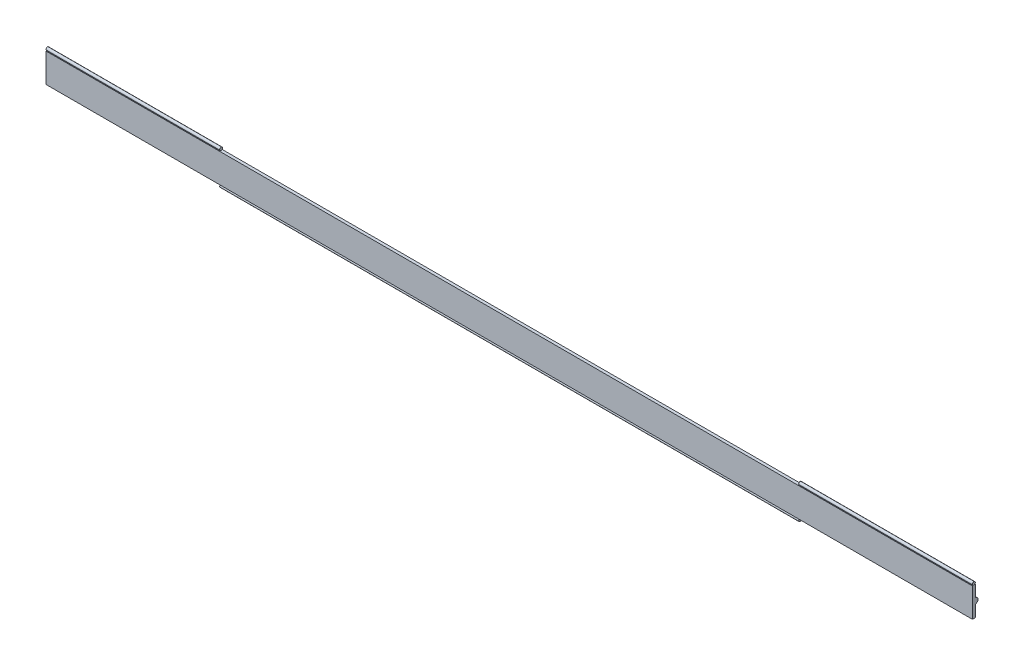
ISO-10303-21;
HEADER;
FILE_DESCRIPTION(('STEP AP214'),'2;1');
FILE_NAME('part.step','',(''),(''),'','','');
FILE_SCHEMA(('AUTOMOTIVE_DESIGN { 1 0 10303 214 1 1 1 1 }'));
ENDSEC;
DATA;
#1=APPLICATION_CONTEXT('core data for automotive mechanical design processes');
#2=APPLICATION_PROTOCOL_DEFINITION('international standard','automotive_design',2000,#1);
#3=PRODUCT_CONTEXT('',#1,'mechanical');
#4=PRODUCT('Part','Part','',(#3));
#5=PRODUCT_RELATED_PRODUCT_CATEGORY('part','',(#4));
#6=PRODUCT_DEFINITION_FORMATION('','',#4);
#7=PRODUCT_DEFINITION_CONTEXT('part definition',#1,'design');
#8=PRODUCT_DEFINITION('design','',#6,#7);
#9=PRODUCT_DEFINITION_SHAPE('','',#8);
#10=(LENGTH_UNIT() NAMED_UNIT(*) SI_UNIT(.MILLI.,.METRE.));
#11=(NAMED_UNIT(*) PLANE_ANGLE_UNIT() SI_UNIT($,.RADIAN.));
#12=(NAMED_UNIT(*) SI_UNIT($,.STERADIAN.) SOLID_ANGLE_UNIT());
#13=UNCERTAINTY_MEASURE_WITH_UNIT(LENGTH_MEASURE(1.E-05),#10,'distance_accuracy_value','');
#14=(GEOMETRIC_REPRESENTATION_CONTEXT(3) GLOBAL_UNCERTAINTY_ASSIGNED_CONTEXT((#13)) GLOBAL_UNIT_ASSIGNED_CONTEXT((#10,
#11,#12)) REPRESENTATION_CONTEXT('',''));
#15=CARTESIAN_POINT('',(0.,0.,0.));
#16=DIRECTION('',(0.,0.,1.));
#17=DIRECTION('',(1.,0.,0.));
#18=AXIS2_PLACEMENT_3D('',#15,#16,#17);
#19=CARTESIAN_POINT('',(0.,26.67,1.27));
#20=DIRECTION('',(1.,0.,0.));
#21=DIRECTION('',(0.,0.,-1.));
#22=AXIS2_PLACEMENT_3D('',#19,#20,#21);
#23=CYLINDRICAL_SURFACE('',#22,1.27);
#24=CARTESIAN_POINT('',(660.4,26.67,1.27));
#25=DIRECTION('',(1.,0.,0.));
#26=DIRECTION('',(0.,0.,-1.));
#27=AXIS2_PLACEMENT_3D('',#24,#25,#26);
#28=CIRCLE('',#27,1.27);
#29=CARTESIAN_POINT('',(660.4,26.67,0.));
#30=VERTEX_POINT('',#29);
#31=EDGE_CURVE('E11',#30,#30,#28,.F.);
#32=ORIENTED_EDGE('',*,*,#31,.F.);
#33=EDGE_LOOP('',(#32));
#34=FACE_BOUND('',#33,.T.);
#35=CARTESIAN_POINT('',(812.8,26.67,1.27));
#36=DIRECTION('',(1.,0.,0.));
#37=DIRECTION('',(0.,0.,-1.));
#38=AXIS2_PLACEMENT_3D('',#35,#36,#37);
#39=CIRCLE('',#38,1.27);
#40=CARTESIAN_POINT('',(812.8,26.67,0.));
#41=VERTEX_POINT('',#40);
#42=EDGE_CURVE('E42',#41,#41,#39,.T.);
#43=ORIENTED_EDGE('',*,*,#42,.F.);
#44=EDGE_LOOP('',(#43));
#45=FACE_BOUND('',#44,.T.);
#46=ADVANCED_FACE('F39',(#34,#45),#23,.T.);
#47=CARTESIAN_POINT('',(812.8,26.67,1.27));
#48=DIRECTION('',(1.,0.,0.));
#49=DIRECTION('',(0.,0.,-1.));
#50=AXIS2_PLACEMENT_3D('',#47,#48,#49);
#51=PLANE('',#50);
#52=ORIENTED_EDGE('',*,*,#42,.T.);
#53=EDGE_LOOP('',(#52));
#54=FACE_BOUND('',#53,.T.);
#55=ADVANCED_FACE('F51',(#54),#51,.T.);
#56=CARTESIAN_POINT('',(660.4,44.4709717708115,2.54));
#57=DIRECTION('',(1.,0.,0.));
#58=DIRECTION('',(0.,0.,-1.));
#59=AXIS2_PLACEMENT_3D('',#56,#57,#58);
#60=PLANE('',#59);
#61=ORIENTED_EDGE('',*,*,#31,.T.);
#62=EDGE_LOOP('',(#61));
#63=FACE_BOUND('',#62,.T.);
#64=ADVANCED_FACE('F58',(#63),#60,.F.);
#65=CLOSED_SHELL('',(#46,#55,#64));
#66=MANIFOLD_SOLID_BREP('B2',#65);
#67=CARTESIAN_POINT('',(0.,26.67,1.27));
#68=DIRECTION('',(1.,0.,0.));
#69=DIRECTION('',(0.,0.,-1.));
#70=AXIS2_PLACEMENT_3D('',#67,#68,#69);
#71=PLANE('',#70);
#72=CARTESIAN_POINT('',(0.,26.67,1.27));
#73=DIRECTION('',(1.,0.,0.));
#74=DIRECTION('',(0.,0.,-1.));
#75=AXIS2_PLACEMENT_3D('',#72,#73,#74);
#76=CIRCLE('',#75,1.27);
#77=CARTESIAN_POINT('',(0.,26.67,0.));
#78=VERTEX_POINT('',#77);
#79=EDGE_CURVE('E94',#78,#78,#76,.T.);
#80=ORIENTED_EDGE('',*,*,#79,.F.);
#81=EDGE_LOOP('',(#80));
#82=FACE_BOUND('',#81,.T.);
#83=ADVANCED_FACE('F87',(#82),#71,.F.);
#84=CARTESIAN_POINT('',(0.,26.67,1.27));
#85=DIRECTION('',(1.,0.,0.));
#86=DIRECTION('',(0.,0.,-1.));
#87=AXIS2_PLACEMENT_3D('',#84,#85,#86);
#88=CYLINDRICAL_SURFACE('',#87,1.27);
#89=CARTESIAN_POINT('',(152.4,26.67,1.27));
#90=DIRECTION('',(-1.,0.,0.));
#91=DIRECTION('',(0.,0.,1.));
#92=AXIS2_PLACEMENT_3D('',#89,#90,#91);
#93=CIRCLE('',#92,1.27);
#94=CARTESIAN_POINT('',(152.4,26.67,2.54));
#95=VERTEX_POINT('',#94);
#96=EDGE_CURVE('E38',#95,#95,#93,.F.);
#97=ORIENTED_EDGE('',*,*,#96,.F.);
#98=EDGE_LOOP('',(#97));
#99=FACE_BOUND('',#98,.T.);
#100=ORIENTED_EDGE('',*,*,#79,.T.);
#101=EDGE_LOOP('',(#100));
#102=FACE_BOUND('',#101,.T.);
#103=ADVANCED_FACE('F89',(#99,#102),#88,.T.);
#104=CARTESIAN_POINT('',(152.4,25.4,2.54));
#105=DIRECTION('',(-1.,0.,0.));
#106=DIRECTION('',(0.,0.,1.));
#107=AXIS2_PLACEMENT_3D('',#104,#105,#106);
#108=PLANE('',#107);
#109=ORIENTED_EDGE('',*,*,#96,.T.);
#110=EDGE_LOOP('',(#109));
#111=FACE_BOUND('',#110,.T.);
#112=ADVANCED_FACE('F105',(#111),#108,.F.);
#113=CLOSED_SHELL('',(#83,#103,#112));
#114=MANIFOLD_SOLID_BREP('B6',#113);
#115=CARTESIAN_POINT('',(0.,-1.27,1.27));
#116=DIRECTION('',(1.,0.,0.));
#117=DIRECTION('',(0.,0.,-1.));
#118=AXIS2_PLACEMENT_3D('',#115,#116,#117);
#119=CYLINDRICAL_SURFACE('',#118,1.27);
#120=CARTESIAN_POINT('',(152.4,-1.27,1.27));
#121=DIRECTION('',(1.,0.,0.));
#122=DIRECTION('',(0.,0.,-1.));
#123=AXIS2_PLACEMENT_3D('',#120,#121,#122);
#124=CIRCLE('',#123,1.27);
#125=CARTESIAN_POINT('',(152.4,-1.27,0.));
#126=VERTEX_POINT('',#125);
#127=EDGE_CURVE('E86',#126,#126,#124,.F.);
#128=ORIENTED_EDGE('',*,*,#127,.F.);
#129=EDGE_LOOP('',(#128));
#130=FACE_BOUND('',#129,.T.);
#131=CARTESIAN_POINT('',(660.4,-1.27,1.27));
#132=DIRECTION('',(-1.,0.,0.));
#133=DIRECTION('',(0.,0.,1.));
#134=AXIS2_PLACEMENT_3D('',#131,#132,#133);
#135=CIRCLE('',#134,1.27);
#136=CARTESIAN_POINT('',(660.4,-1.27,2.54));
#137=VERTEX_POINT('',#136);
#138=EDGE_CURVE('E142',#137,#137,#135,.F.);
#139=ORIENTED_EDGE('',*,*,#138,.F.);
#140=EDGE_LOOP('',(#139));
#141=FACE_BOUND('',#140,.T.);
#142=ADVANCED_FACE('F136',(#130,#141),#119,.T.);
#143=CARTESIAN_POINT('',(660.4,-18.3832327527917,2.54));
#144=DIRECTION('',(-1.,0.,0.));
#145=DIRECTION('',(0.,0.,1.));
#146=AXIS2_PLACEMENT_3D('',#143,#144,#145);
#147=PLANE('',#146);
#148=ORIENTED_EDGE('',*,*,#138,.T.);
#149=EDGE_LOOP('',(#148));
#150=FACE_BOUND('',#149,.T.);
#151=ADVANCED_FACE('F148',(#150),#147,.F.);
#152=CARTESIAN_POINT('',(152.4,0.,2.54));
#153=DIRECTION('',(1.,0.,0.));
#154=DIRECTION('',(0.,0.,-1.));
#155=AXIS2_PLACEMENT_3D('',#152,#153,#154);
#156=PLANE('',#155);
#157=ORIENTED_EDGE('',*,*,#127,.T.);
#158=EDGE_LOOP('',(#157));
#159=FACE_BOUND('',#158,.T.);
#160=ADVANCED_FACE('F155',(#159),#156,.F.);
#161=CLOSED_SHELL('',(#142,#151,#160));
#162=MANIFOLD_SOLID_BREP('B33',#161);
#163=CARTESIAN_POINT('',(0.,0.,0.));
#164=DIRECTION('',(0.,0.,-1.));
#165=DIRECTION('',(-1.,0.,0.));
#166=AXIS2_PLACEMENT_3D('',#163,#164,#165);
#167=PLANE('',#166);
#168=DIRECTION('',(0.,-1.,0.));
#169=VECTOR('',#168,1.);
#170=CARTESIAN_POINT('',(0.,0.,0.));
#171=LINE('',#170,#169);
#172=CARTESIAN_POINT('',(0.,10.334228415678,0.));
#173=VERTEX_POINT('',#172);
#174=CARTESIAN_POINT('',(0.,0.,0.));
#175=VERTEX_POINT('',#174);
#176=EDGE_CURVE('E255',#173,#175,#171,.T.);
#177=ORIENTED_EDGE('',*,*,#176,.F.);
#178=DIRECTION('',(-1.,0.,0.));
#179=VECTOR('',#178,1.);
#180=CARTESIAN_POINT('',(812.8,10.334228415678,0.));
#181=LINE('',#180,#179);
#182=CARTESIAN_POINT('',(812.8,10.334228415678,0.));
#183=VERTEX_POINT('',#182);
#184=EDGE_CURVE('E248',#183,#173,#181,.T.);
#185=ORIENTED_EDGE('',*,*,#184,.F.);
#186=DIRECTION('',(0.,1.,0.));
#187=VECTOR('',#186,1.);
#188=CARTESIAN_POINT('',(812.8,0.,0.));
#189=LINE('',#188,#187);
#190=CARTESIAN_POINT('',(812.8,0.,0.));
#191=VERTEX_POINT('',#190);
#192=EDGE_CURVE('E245',#191,#183,#189,.T.);
#193=ORIENTED_EDGE('',*,*,#192,.F.);
#194=DIRECTION('',(1.,0.,0.));
#195=VECTOR('',#194,1.);
#196=CARTESIAN_POINT('',(0.,0.,0.));
#197=LINE('',#196,#195);
#198=EDGE_CURVE('E258',#175,#191,#197,.T.);
#199=ORIENTED_EDGE('',*,*,#198,.F.);
#200=EDGE_LOOP('',(#177,#185,#193,#199));
#201=FACE_BOUND('',#200,.T.);
#202=ADVANCED_FACE('F176',(#201),#167,.T.);
#203=CARTESIAN_POINT('',(812.8,15.065771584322,0.));
#204=VERTEX_POINT('',#203);
#205=CARTESIAN_POINT('',(812.8,25.4,0.));
#206=VERTEX_POINT('',#205);
#207=EDGE_CURVE('E242',#204,#206,#189,.T.);
#208=ORIENTED_EDGE('',*,*,#207,.F.);
#209=DIRECTION('',(-1.,0.,0.));
#210=VECTOR('',#209,1.);
#211=CARTESIAN_POINT('',(812.8,15.065771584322,0.));
#212=LINE('',#211,#210);
#213=CARTESIAN_POINT('',(0.,15.065771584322,0.));
#214=VERTEX_POINT('',#213);
#215=EDGE_CURVE('E251',#204,#214,#212,.T.);
#216=ORIENTED_EDGE('',*,*,#215,.T.);
#217=CARTESIAN_POINT('',(0.,25.4,0.));
#218=VERTEX_POINT('',#217);
#219=EDGE_CURVE('E260',#218,#214,#171,.T.);
#220=ORIENTED_EDGE('',*,*,#219,.F.);
#221=DIRECTION('',(-1.,0.,0.));
#222=VECTOR('',#221,1.);
#223=CARTESIAN_POINT('',(0.,25.4,0.));
#224=LINE('',#223,#222);
#225=EDGE_CURVE('E220',#206,#218,#224,.T.);
#226=ORIENTED_EDGE('',*,*,#225,.F.);
#227=EDGE_LOOP('',(#208,#216,#220,#226));
#228=FACE_BOUND('',#227,.T.);
#229=ADVANCED_FACE('F257',(#228),#167,.T.);
#230=CARTESIAN_POINT('',(0.,0.,2.54));
#231=DIRECTION('',(1.,0.,0.));
#232=DIRECTION('',(0.,0.,-1.));
#233=AXIS2_PLACEMENT_3D('',#230,#231,#232);
#234=PLANE('',#233);
#235=ORIENTED_EDGE('',*,*,#219,.T.);
#236=CARTESIAN_POINT('',(0.,12.7,0.));
#237=DIRECTION('',(1.,0.,0.));
#238=DIRECTION('',(0.,0.,1.));
#239=AXIS2_PLACEMENT_3D('',#236,#237,#238);
#240=CIRCLE('',#239,2.36577158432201);
#241=EDGE_CURVE('E191',#173,#214,#240,.T.);
#242=ORIENTED_EDGE('',*,*,#241,.F.);
#243=ORIENTED_EDGE('',*,*,#176,.T.);
#244=DIRECTION('',(0.,0.,-1.));
#245=VECTOR('',#244,1.);
#246=CARTESIAN_POINT('',(0.,0.,2.54));
#247=LINE('',#246,#245);
#248=CARTESIAN_POINT('',(0.,0.,2.54));
#249=VERTEX_POINT('',#248);
#250=EDGE_CURVE('E134',#249,#175,#247,.T.);
#251=ORIENTED_EDGE('',*,*,#250,.F.);
#252=DIRECTION('',(0.,-1.,0.));
#253=VECTOR('',#252,1.);
#254=CARTESIAN_POINT('',(0.,0.,2.54));
#255=LINE('',#254,#253);
#256=CARTESIAN_POINT('',(0.,25.4,2.54));
#257=VERTEX_POINT('',#256);
#258=EDGE_CURVE('E265',#257,#249,#255,.T.);
#259=ORIENTED_EDGE('',*,*,#258,.F.);
#260=DIRECTION('',(0.,0.,-1.));
#261=VECTOR('',#260,1.);
#262=CARTESIAN_POINT('',(0.,25.4,2.54));
#263=LINE('',#262,#261);
#264=EDGE_CURVE('E266',#257,#218,#263,.T.);
#265=ORIENTED_EDGE('',*,*,#264,.T.);
#266=EDGE_LOOP('',(#235,#242,#243,#251,#259,#265));
#267=FACE_BOUND('',#266,.T.);
#268=ADVANCED_FACE('F178',(#267),#234,.F.);
#269=CARTESIAN_POINT('',(0.,0.,2.54));
#270=DIRECTION('',(0.,1.,0.));
#271=DIRECTION('',(0.,0.,1.));
#272=AXIS2_PLACEMENT_3D('',#269,#270,#271);
#273=PLANE('',#272);
#274=DIRECTION('',(0.,0.,-1.));
#275=VECTOR('',#274,1.);
#276=CARTESIAN_POINT('',(812.8,0.,2.54));
#277=LINE('',#276,#275);
#278=CARTESIAN_POINT('',(812.8,0.,2.54));
#279=VERTEX_POINT('',#278);
#280=EDGE_CURVE('E184',#279,#191,#277,.T.);
#281=ORIENTED_EDGE('',*,*,#280,.F.);
#282=DIRECTION('',(1.,0.,0.));
#283=VECTOR('',#282,1.);
#284=CARTESIAN_POINT('',(0.,0.,2.54));
#285=LINE('',#284,#283);
#286=EDGE_CURVE('E227',#249,#279,#285,.T.);
#287=ORIENTED_EDGE('',*,*,#286,.F.);
#288=ORIENTED_EDGE('',*,*,#250,.T.);
#289=ORIENTED_EDGE('',*,*,#198,.T.);
#290=EDGE_LOOP('',(#281,#287,#288,#289));
#291=FACE_BOUND('',#290,.T.);
#292=ADVANCED_FACE('F282',(#291),#273,.F.);
#293=CARTESIAN_POINT('',(812.8,0.,2.54));
#294=DIRECTION('',(-1.,0.,0.));
#295=DIRECTION('',(0.,0.,1.));
#296=AXIS2_PLACEMENT_3D('',#293,#294,#295);
#297=PLANE('',#296);
#298=ORIENTED_EDGE('',*,*,#192,.T.);
#299=CARTESIAN_POINT('',(812.8,12.7,0.));
#300=DIRECTION('',(1.,0.,0.));
#301=DIRECTION('',(0.,0.,1.));
#302=AXIS2_PLACEMENT_3D('',#299,#300,#301);
#303=CIRCLE('',#302,2.36577158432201);
#304=EDGE_CURVE('E237',#183,#204,#303,.T.);
#305=ORIENTED_EDGE('',*,*,#304,.T.);
#306=ORIENTED_EDGE('',*,*,#207,.T.);
#307=DIRECTION('',(0.,0.,-1.));
#308=VECTOR('',#307,1.);
#309=CARTESIAN_POINT('',(812.8,25.4,2.54));
#310=LINE('',#309,#308);
#311=CARTESIAN_POINT('',(812.8,25.4,2.54));
#312=VERTEX_POINT('',#311);
#313=EDGE_CURVE('E268',#312,#206,#310,.T.);
#314=ORIENTED_EDGE('',*,*,#313,.F.);
#315=DIRECTION('',(0.,1.,0.));
#316=VECTOR('',#315,1.);
#317=CARTESIAN_POINT('',(812.8,0.,2.54));
#318=LINE('',#317,#316);
#319=EDGE_CURVE('E270',#279,#312,#318,.T.);
#320=ORIENTED_EDGE('',*,*,#319,.F.);
#321=ORIENTED_EDGE('',*,*,#280,.T.);
#322=EDGE_LOOP('',(#298,#305,#306,#314,#320,#321));
#323=FACE_BOUND('',#322,.T.);
#324=ADVANCED_FACE('F239',(#323),#297,.F.);
#325=CARTESIAN_POINT('',(0.,25.4,2.54));
#326=DIRECTION('',(0.,-1.,0.));
#327=DIRECTION('',(0.,0.,-1.));
#328=AXIS2_PLACEMENT_3D('',#325,#326,#327);
#329=PLANE('',#328);
#330=ORIENTED_EDGE('',*,*,#264,.F.);
#331=DIRECTION('',(-1.,0.,0.));
#332=VECTOR('',#331,1.);
#333=CARTESIAN_POINT('',(0.,25.4,2.54));
#334=LINE('',#333,#332);
#335=EDGE_CURVE('E200',#312,#257,#334,.T.);
#336=ORIENTED_EDGE('',*,*,#335,.F.);
#337=ORIENTED_EDGE('',*,*,#313,.T.);
#338=ORIENTED_EDGE('',*,*,#225,.T.);
#339=EDGE_LOOP('',(#330,#336,#337,#338));
#340=FACE_BOUND('',#339,.T.);
#341=ADVANCED_FACE('F288',(#340),#329,.F.);
#342=CARTESIAN_POINT('',(0.,0.,2.54));
#343=DIRECTION('',(0.,0.,-1.));
#344=DIRECTION('',(-1.,0.,0.));
#345=AXIS2_PLACEMENT_3D('',#342,#343,#344);
#346=PLANE('',#345);
#347=ORIENTED_EDGE('',*,*,#258,.T.);
#348=ORIENTED_EDGE('',*,*,#286,.T.);
#349=ORIENTED_EDGE('',*,*,#319,.T.);
#350=ORIENTED_EDGE('',*,*,#335,.T.);
#351=EDGE_LOOP('',(#347,#348,#349,#350));
#352=FACE_BOUND('',#351,.T.);
#353=ADVANCED_FACE('F297',(#352),#346,.F.);
#354=CARTESIAN_POINT('',(812.8,12.7,0.));
#355=DIRECTION('',(-1.,0.,0.));
#356=DIRECTION('',(0.,0.,1.));
#357=AXIS2_PLACEMENT_3D('',#354,#355,#356);
#358=CYLINDRICAL_SURFACE('',#357,2.36577158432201);
#359=ORIENTED_EDGE('',*,*,#241,.T.);
#360=ORIENTED_EDGE('',*,*,#215,.F.);
#361=ORIENTED_EDGE('',*,*,#304,.F.);
#362=ORIENTED_EDGE('',*,*,#184,.T.);
#363=EDGE_LOOP('',(#359,#360,#361,#362));
#364=FACE_BOUND('',#363,.T.);
#365=ADVANCED_FACE('F252',(#364),#358,.T.);
#366=CLOSED_SHELL('',(#202,#229,#268,#292,#324,#341,#353,#365));
#367=MANIFOLD_SOLID_BREP('B81',#366);
#368=ADVANCED_BREP_SHAPE_REPRESENTATION('',(#18,#66,#114,#162,#367),#14);
#369=SHAPE_DEFINITION_REPRESENTATION(#9,#368);
ENDSEC;
END-ISO-10303-21;
